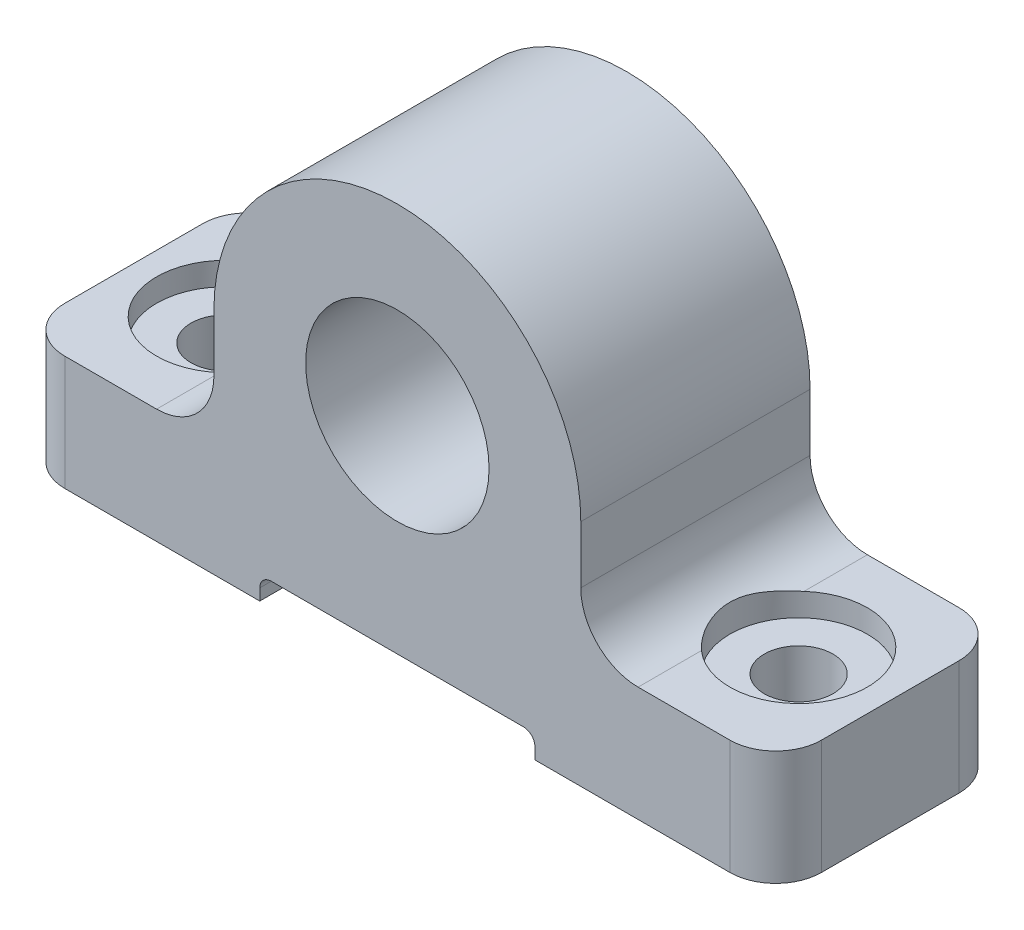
from build123d import *

# Parameters (mm, degrees)
SKETCH_1_R          = 8
EXTRUDE_1_DEPTH     = 10
SKETCH_3_R          = 3
CUT_EXTRUDE_1_DEPTH = 45.912914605
SKETCH_5_R          = 6
CUT_EXTRUDE_2_DEPTH = 20.777941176
FILLET_1_R          = 4


with BuildPart() as part:
    # Sketch 1 → Extrude 1 (new, symmetric)
    with BuildSketch(Plane.XY):
        with BuildLine():
            Line((-12, -28.777941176), (-33, -28.777941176))
            Line((-33, -28.777941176), (-33, -18.777941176))
            Line((-33, -18.777941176), (-21, -18.777941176))
            ThreePointArc((-21, -18.777941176), (-17.464466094, -17.313475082), (-16, -13.777941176))
            Line((-16, -13.777941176), (-16, -8.777941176))
            ThreePointArc((-16, -8.777941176), (0, 7.222058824), (16, -8.777941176))
            Line((16, -8.777941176), (16, -13.777941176))
            ThreePointArc((16, -13.777941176), (17.464466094, -17.313475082), (21, -18.777941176))
            Line((21, -18.777941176), (33, -18.777941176))
            Line((33, -18.777941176), (33, -28.777941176))
            Line((33, -28.777941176), (12, -28.777941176))
            Line((12, -28.777941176), (12, -27.777941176))
            ThreePointArc((12, -27.777941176), (11.707106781, -27.070834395), (11, -26.777941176))
            Line((11, -26.777941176), (-11, -26.777941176))
            ThreePointArc((-11, -26.777941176), (-11.707106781, -27.070834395), (-12, -27.777941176))
            Line((-12, -27.777941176), (-12, -28.777941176))
        make_face()
        with Locations((0, -8.777941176)):
            Circle(SKETCH_1_R, mode=Mode.SUBTRACT)
    extrude(amount=EXTRUDE_1_DEPTH, both=True)

    # Sketch 3 → Cut-Extrude 1 (cut, through all)
    with BuildSketch(Plane(origin=(0, 0, 0), x_dir=(1, 0, 0), z_dir=(0, 1, 0))):
        with Locations(Location((-25, 0, 0), (0, 0, 270))):
            Circle(SKETCH_3_R)
        with Locations(Location((25, 0, 0), (0, 0, 270))):
            Circle(SKETCH_3_R)
    extrude(amount=-CUT_EXTRUDE_1_DEPTH, mode=Mode.SUBTRACT)

    # Sketch 5 → Cut-Extrude 2 (cut)
    with BuildSketch(Plane(origin=(0, 0, 0), x_dir=(1, 0, 0), z_dir=(0, 1, 0))):
        with Locations(Location((-25, 0, 0), (0, 0, 311.810314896))):
            Circle(SKETCH_5_R)
        with Locations(Location((25, 0, 0), (0, 0, 228.189685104))):
            Circle(SKETCH_5_R)
    extrude(amount=-CUT_EXTRUDE_2_DEPTH, mode=Mode.SUBTRACT)

    # Fillet 1
    fillet_1_edges = [part.edges().sort_by_distance(p)[0] for p in [
        (33, -23.777941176, -10),
        (-33, -23.777941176, 10),
        (-33, -23.777941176, -10),
        (33, -23.777941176, 10),
    ]]
    fillet(fillet_1_edges, radius=FILLET_1_R)


solid = part.part
